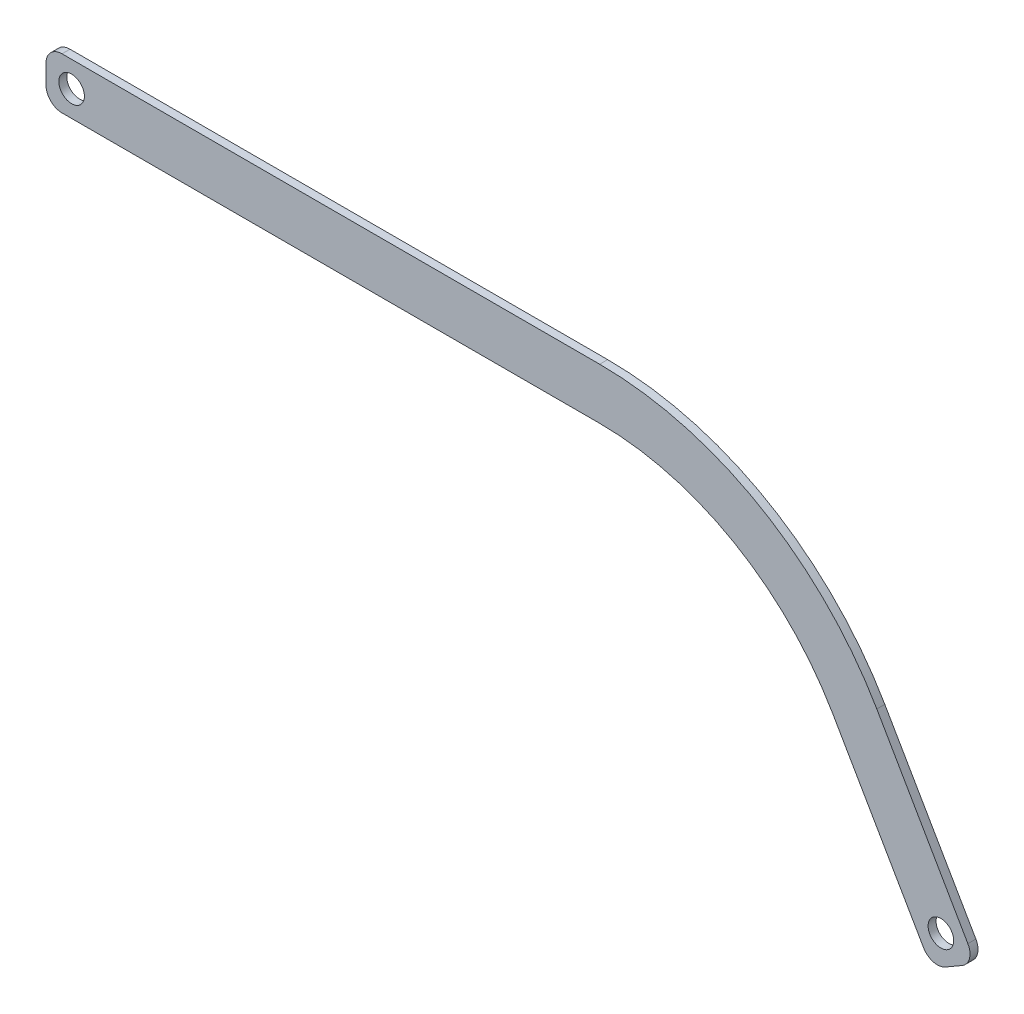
ISO-10303-21;
HEADER;
FILE_DESCRIPTION(('STEP AP214'),'2;1');
FILE_NAME('part.step','',(''),(''),'','','');
FILE_SCHEMA(('AUTOMOTIVE_DESIGN { 1 0 10303 214 1 1 1 1 }'));
ENDSEC;
DATA;
#1=APPLICATION_CONTEXT('core data for automotive mechanical design processes');
#2=APPLICATION_PROTOCOL_DEFINITION('international standard','automotive_design',2000,#1);
#3=PRODUCT_CONTEXT('',#1,'mechanical');
#4=PRODUCT('Part','Part','',(#3));
#5=PRODUCT_RELATED_PRODUCT_CATEGORY('part','',(#4));
#6=PRODUCT_DEFINITION_FORMATION('','',#4);
#7=PRODUCT_DEFINITION_CONTEXT('part definition',#1,'design');
#8=PRODUCT_DEFINITION('design','',#6,#7);
#9=PRODUCT_DEFINITION_SHAPE('','',#8);
#10=(LENGTH_UNIT() NAMED_UNIT(*) SI_UNIT(.MILLI.,.METRE.));
#11=(NAMED_UNIT(*) PLANE_ANGLE_UNIT() SI_UNIT($,.RADIAN.));
#12=(NAMED_UNIT(*) SI_UNIT($,.STERADIAN.) SOLID_ANGLE_UNIT());
#13=UNCERTAINTY_MEASURE_WITH_UNIT(LENGTH_MEASURE(1.E-05),#10,'distance_accuracy_value','');
#14=(GEOMETRIC_REPRESENTATION_CONTEXT(3) GLOBAL_UNCERTAINTY_ASSIGNED_CONTEXT((#13)) GLOBAL_UNIT_ASSIGNED_CONTEXT((#10,
#11,#12)) REPRESENTATION_CONTEXT('',''));
#15=CARTESIAN_POINT('',(0.,0.,0.));
#16=DIRECTION('',(0.,0.,1.));
#17=DIRECTION('',(1.,0.,0.));
#18=AXIS2_PLACEMENT_3D('',#15,#16,#17);
#19=CARTESIAN_POINT('',(330.,-184.,-5.));
#20=DIRECTION('',(0.,0.,1.));
#21=DIRECTION('',(1.,0.,0.));
#22=AXIS2_PLACEMENT_3D('',#19,#20,#21);
#23=CYLINDRICAL_SURFACE('',#22,200.);
#24=CARTESIAN_POINT('',(330.,-184.,0.));
#25=DIRECTION('',(0.,0.,1.));
#26=DIRECTION('',(1.,0.,0.));
#27=AXIS2_PLACEMENT_3D('',#24,#25,#26);
#28=CIRCLE('',#27,200.);
#29=CARTESIAN_POINT('',(503.205080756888,-83.9999999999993,0.));
#30=VERTEX_POINT('',#29);
#31=CARTESIAN_POINT('',(330.,16.,0.));
#32=VERTEX_POINT('',#31);
#33=EDGE_CURVE('E114',#30,#32,#28,.T.);
#34=ORIENTED_EDGE('',*,*,#33,.F.);
#35=DIRECTION('',(0.,0.,1.));
#36=VECTOR('',#35,1.);
#37=CARTESIAN_POINT('',(503.205080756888,-83.9999999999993,-5.));
#38=LINE('',#37,#36);
#39=CARTESIAN_POINT('',(503.205080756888,-83.9999999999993,-5.));
#40=VERTEX_POINT('',#39);
#41=EDGE_CURVE('E11',#40,#30,#38,.T.);
#42=ORIENTED_EDGE('',*,*,#41,.F.);
#43=CARTESIAN_POINT('',(330.,-184.,-5.));
#44=DIRECTION('',(0.,0.,1.));
#45=DIRECTION('',(1.,0.,0.));
#46=AXIS2_PLACEMENT_3D('',#43,#44,#45);
#47=CIRCLE('',#46,200.);
#48=CARTESIAN_POINT('',(330.,16.,-5.));
#49=VERTEX_POINT('',#48);
#50=EDGE_CURVE('E116',#40,#49,#47,.T.);
#51=ORIENTED_EDGE('',*,*,#50,.T.);
#52=DIRECTION('',(0.,0.,1.));
#53=VECTOR('',#52,1.);
#54=CARTESIAN_POINT('',(330.,16.,-5.));
#55=LINE('',#54,#53);
#56=EDGE_CURVE('E29',#49,#32,#55,.T.);
#57=ORIENTED_EDGE('',*,*,#56,.T.);
#58=EDGE_LOOP('',(#34,#42,#51,#57));
#59=FACE_BOUND('',#58,.T.);
#60=ADVANCED_FACE('F26',(#59),#23,.T.);
#61=CARTESIAN_POINT('',(503.205080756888,-83.9999999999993,-5.));
#62=DIRECTION('',(0.866025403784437,0.500000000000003,0.));
#63=DIRECTION('',(-0.500000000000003,0.866025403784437,0.));
#64=AXIS2_PLACEMENT_3D('',#61,#62,#63);
#65=PLANE('',#64);
#66=DIRECTION('',(-0.500000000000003,0.866025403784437,0.));
#67=VECTOR('',#66,1.);
#68=CARTESIAN_POINT('',(503.205080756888,-83.9999999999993,0.));
#69=LINE('',#68,#67);
#70=CARTESIAN_POINT('',(560.104768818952,-182.553150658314,0.));
#71=VERTEX_POINT('',#70);
#72=EDGE_CURVE('E132',#71,#30,#69,.T.);
#73=ORIENTED_EDGE('',*,*,#72,.F.);
#74=DIRECTION('',(0.,0.,1.));
#75=VECTOR('',#74,1.);
#76=CARTESIAN_POINT('',(560.104768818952,-182.553150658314,-5.));
#77=LINE('',#76,#75);
#78=CARTESIAN_POINT('',(560.104768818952,-182.553150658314,-5.));
#79=VERTEX_POINT('',#78);
#80=EDGE_CURVE('E34',#79,#71,#77,.T.);
#81=ORIENTED_EDGE('',*,*,#80,.F.);
#82=DIRECTION('',(-0.500000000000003,0.866025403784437,0.));
#83=VECTOR('',#82,1.);
#84=CARTESIAN_POINT('',(503.205080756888,-83.9999999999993,-5.));
#85=LINE('',#84,#83);
#86=EDGE_CURVE('E121',#79,#40,#85,.T.);
#87=ORIENTED_EDGE('',*,*,#86,.T.);
#88=ORIENTED_EDGE('',*,*,#41,.T.);
#89=EDGE_LOOP('',(#73,#81,#87,#88));
#90=FACE_BOUND('',#89,.T.);
#91=ADVANCED_FACE('F244',(#90),#65,.T.);
#92=CARTESIAN_POINT('',(551.444514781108,-187.553150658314,-5.));
#93=DIRECTION('',(0.,0.,1.));
#94=DIRECTION('',(1.,0.,0.));
#95=AXIS2_PLACEMENT_3D('',#92,#93,#94);
#96=CYLINDRICAL_SURFACE('',#95,10.0000000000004);
#97=CARTESIAN_POINT('',(551.444514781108,-187.553150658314,0.));
#98=DIRECTION('',(0.,0.,1.));
#99=DIRECTION('',(-1.,0.,0.));
#100=AXIS2_PLACEMENT_3D('',#97,#98,#99);
#101=CIRCLE('',#100,10.0000000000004);
#102=CARTESIAN_POINT('',(556.444514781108,-196.213404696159,0.));
#103=VERTEX_POINT('',#102);
#104=EDGE_CURVE('E162',#103,#71,#101,.T.);
#105=ORIENTED_EDGE('',*,*,#104,.F.);
#106=DIRECTION('',(0.,0.,1.));
#107=VECTOR('',#106,1.);
#108=CARTESIAN_POINT('',(556.444514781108,-196.213404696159,-5.));
#109=LINE('',#108,#107);
#110=CARTESIAN_POINT('',(556.444514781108,-196.213404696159,-5.));
#111=VERTEX_POINT('',#110);
#112=EDGE_CURVE('E196',#111,#103,#109,.T.);
#113=ORIENTED_EDGE('',*,*,#112,.F.);
#114=CARTESIAN_POINT('',(551.444514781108,-187.553150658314,-5.));
#115=DIRECTION('',(0.,0.,1.));
#116=DIRECTION('',(-1.,0.,0.));
#117=AXIS2_PLACEMENT_3D('',#114,#115,#116);
#118=CIRCLE('',#117,10.0000000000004);
#119=EDGE_CURVE('E192',#111,#79,#118,.T.);
#120=ORIENTED_EDGE('',*,*,#119,.T.);
#121=ORIENTED_EDGE('',*,*,#80,.T.);
#122=EDGE_LOOP('',(#105,#113,#120,#121));
#123=FACE_BOUND('',#122,.T.);
#124=ADVANCED_FACE('F249',(#123),#96,.T.);
#125=CARTESIAN_POINT('',(556.444514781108,-196.213404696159,-5.));
#126=DIRECTION('',(0.500000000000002,-0.866025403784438,0.));
#127=DIRECTION('',(0.866025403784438,0.500000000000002,0.));
#128=AXIS2_PLACEMENT_3D('',#125,#126,#127);
#129=PLANE('',#128);
#130=DIRECTION('',(0.866025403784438,0.500000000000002,0.));
#131=VECTOR('',#130,1.);
#132=CARTESIAN_POINT('',(556.444514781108,-196.213404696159,0.));
#133=LINE('',#132,#131);
#134=CARTESIAN_POINT('',(546.052209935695,-202.213404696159,0.));
#135=VERTEX_POINT('',#134);
#136=EDGE_CURVE('E159',#135,#103,#133,.T.);
#137=ORIENTED_EDGE('',*,*,#136,.F.);
#138=DIRECTION('',(0.,0.,1.));
#139=VECTOR('',#138,1.);
#140=CARTESIAN_POINT('',(546.052209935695,-202.213404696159,-5.));
#141=LINE('',#140,#139);
#142=CARTESIAN_POINT('',(546.052209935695,-202.213404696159,-5.));
#143=VERTEX_POINT('',#142);
#144=EDGE_CURVE('E198',#143,#135,#141,.T.);
#145=ORIENTED_EDGE('',*,*,#144,.F.);
#146=DIRECTION('',(0.866025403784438,0.500000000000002,0.));
#147=VECTOR('',#146,1.);
#148=CARTESIAN_POINT('',(556.444514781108,-196.213404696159,-5.));
#149=LINE('',#148,#147);
#150=EDGE_CURVE('E189',#143,#111,#149,.T.);
#151=ORIENTED_EDGE('',*,*,#150,.T.);
#152=ORIENTED_EDGE('',*,*,#112,.T.);
#153=EDGE_LOOP('',(#137,#145,#151,#152));
#154=FACE_BOUND('',#153,.T.);
#155=ADVANCED_FACE('F241',(#154),#129,.T.);
#156=CARTESIAN_POINT('',(541.052209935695,-193.553150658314,-5.));
#157=DIRECTION('',(0.,0.,1.));
#158=DIRECTION('',(1.,0.,0.));
#159=AXIS2_PLACEMENT_3D('',#156,#157,#158);
#160=CYLINDRICAL_SURFACE('',#159,10.0000000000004);
#161=CARTESIAN_POINT('',(541.052209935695,-193.553150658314,0.));
#162=DIRECTION('',(0.,0.,1.));
#163=DIRECTION('',(1.,0.,0.));
#164=AXIS2_PLACEMENT_3D('',#161,#162,#163);
#165=CIRCLE('',#164,10.0000000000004);
#166=CARTESIAN_POINT('',(532.39195589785,-198.553150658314,0.));
#167=VERTEX_POINT('',#166);
#168=EDGE_CURVE('E156',#167,#135,#165,.T.);
#169=ORIENTED_EDGE('',*,*,#168,.F.);
#170=DIRECTION('',(0.,0.,1.));
#171=VECTOR('',#170,1.);
#172=CARTESIAN_POINT('',(532.39195589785,-198.553150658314,-5.));
#173=LINE('',#172,#171);
#174=CARTESIAN_POINT('',(532.39195589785,-198.553150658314,-5.));
#175=VERTEX_POINT('',#174);
#176=EDGE_CURVE('E200',#175,#167,#173,.T.);
#177=ORIENTED_EDGE('',*,*,#176,.F.);
#178=CARTESIAN_POINT('',(541.052209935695,-193.553150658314,-5.));
#179=DIRECTION('',(0.,0.,1.));
#180=DIRECTION('',(1.,0.,0.));
#181=AXIS2_PLACEMENT_3D('',#178,#179,#180);
#182=CIRCLE('',#181,10.0000000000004);
#183=EDGE_CURVE('E186',#175,#143,#182,.T.);
#184=ORIENTED_EDGE('',*,*,#183,.T.);
#185=ORIENTED_EDGE('',*,*,#144,.T.);
#186=EDGE_LOOP('',(#169,#177,#184,#185));
#187=FACE_BOUND('',#186,.T.);
#188=ADVANCED_FACE('F237',(#187),#160,.T.);
#189=CARTESIAN_POINT('',(475.492267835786,-99.9999999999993,-5.));
#190=DIRECTION('',(-0.866025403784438,-0.500000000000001,0.));
#191=DIRECTION('',(0.500000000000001,-0.866025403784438,0.));
#192=AXIS2_PLACEMENT_3D('',#189,#190,#191);
#193=PLANE('',#192);
#194=DIRECTION('',(0.500000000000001,-0.866025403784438,0.));
#195=VECTOR('',#194,1.);
#196=CARTESIAN_POINT('',(475.492267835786,-99.9999999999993,0.));
#197=LINE('',#196,#195);
#198=CARTESIAN_POINT('',(475.492267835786,-99.9999999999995,0.));
#199=VERTEX_POINT('',#198);
#200=EDGE_CURVE('E153',#199,#167,#197,.T.);
#201=ORIENTED_EDGE('',*,*,#200,.F.);
#202=DIRECTION('',(0.,0.,1.));
#203=VECTOR('',#202,1.);
#204=CARTESIAN_POINT('',(475.492267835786,-99.9999999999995,-5.));
#205=LINE('',#204,#203);
#206=CARTESIAN_POINT('',(475.492267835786,-99.9999999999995,-5.));
#207=VERTEX_POINT('',#206);
#208=EDGE_CURVE('E202',#207,#199,#205,.T.);
#209=ORIENTED_EDGE('',*,*,#208,.F.);
#210=DIRECTION('',(0.500000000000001,-0.866025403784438,0.));
#211=VECTOR('',#210,1.);
#212=CARTESIAN_POINT('',(475.492267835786,-99.9999999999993,-5.));
#213=LINE('',#212,#211);
#214=EDGE_CURVE('E183',#207,#175,#213,.T.);
#215=ORIENTED_EDGE('',*,*,#214,.T.);
#216=ORIENTED_EDGE('',*,*,#176,.T.);
#217=EDGE_LOOP('',(#201,#209,#215,#216));
#218=FACE_BOUND('',#217,.T.);
#219=ADVANCED_FACE('F233',(#218),#193,.T.);
#220=CARTESIAN_POINT('',(330.,-184.,-5.));
#221=DIRECTION('',(0.,0.,1.));
#222=DIRECTION('',(1.,0.,0.));
#223=AXIS2_PLACEMENT_3D('',#220,#221,#222);
#224=CYLINDRICAL_SURFACE('',#223,168.);
#225=CARTESIAN_POINT('',(330.,-184.,0.));
#226=DIRECTION('',(0.,0.,-1.));
#227=DIRECTION('',(1.,0.,0.));
#228=AXIS2_PLACEMENT_3D('',#225,#226,#227);
#229=CIRCLE('',#228,168.);
#230=CARTESIAN_POINT('',(330.,-16.,0.));
#231=VERTEX_POINT('',#230);
#232=EDGE_CURVE('E150',#231,#199,#229,.T.);
#233=ORIENTED_EDGE('',*,*,#232,.F.);
#234=DIRECTION('',(0.,0.,1.));
#235=VECTOR('',#234,1.);
#236=CARTESIAN_POINT('',(330.,-16.,-5.));
#237=LINE('',#236,#235);
#238=CARTESIAN_POINT('',(330.,-16.,-5.));
#239=VERTEX_POINT('',#238);
#240=EDGE_CURVE('E204',#239,#231,#237,.T.);
#241=ORIENTED_EDGE('',*,*,#240,.F.);
#242=CARTESIAN_POINT('',(330.,-184.,-5.));
#243=DIRECTION('',(0.,0.,-1.));
#244=DIRECTION('',(1.,0.,0.));
#245=AXIS2_PLACEMENT_3D('',#242,#243,#244);
#246=CIRCLE('',#245,168.);
#247=EDGE_CURVE('E180',#239,#207,#246,.T.);
#248=ORIENTED_EDGE('',*,*,#247,.T.);
#249=ORIENTED_EDGE('',*,*,#208,.T.);
#250=EDGE_LOOP('',(#233,#241,#248,#249));
#251=FACE_BOUND('',#250,.T.);
#252=ADVANCED_FACE('F229',(#251),#224,.F.);
#253=CARTESIAN_POINT('',(-6.,-16.,-5.));
#254=DIRECTION('',(0.,-1.,0.));
#255=DIRECTION('',(1.,0.,0.));
#256=AXIS2_PLACEMENT_3D('',#253,#254,#255);
#257=PLANE('',#256);
#258=DIRECTION('',(1.,0.,0.));
#259=VECTOR('',#258,1.);
#260=CARTESIAN_POINT('',(-6.,-16.,0.));
#261=LINE('',#260,#259);
#262=CARTESIAN_POINT('',(-6.,-16.,0.));
#263=VERTEX_POINT('',#262);
#264=EDGE_CURVE('E147',#263,#231,#261,.T.);
#265=ORIENTED_EDGE('',*,*,#264,.F.);
#266=DIRECTION('',(0.,0.,1.));
#267=VECTOR('',#266,1.);
#268=CARTESIAN_POINT('',(-6.,-16.,-5.));
#269=LINE('',#268,#267);
#270=CARTESIAN_POINT('',(-6.,-16.,-5.));
#271=VERTEX_POINT('',#270);
#272=EDGE_CURVE('E206',#271,#263,#269,.T.);
#273=ORIENTED_EDGE('',*,*,#272,.F.);
#274=DIRECTION('',(1.,0.,0.));
#275=VECTOR('',#274,1.);
#276=CARTESIAN_POINT('',(-6.,-16.,-5.));
#277=LINE('',#276,#275);
#278=EDGE_CURVE('E177',#271,#239,#277,.T.);
#279=ORIENTED_EDGE('',*,*,#278,.T.);
#280=ORIENTED_EDGE('',*,*,#240,.T.);
#281=EDGE_LOOP('',(#265,#273,#279,#280));
#282=FACE_BOUND('',#281,.T.);
#283=ADVANCED_FACE('F225',(#282),#257,.T.);
#284=CARTESIAN_POINT('',(-6.,-6.,-5.));
#285=DIRECTION('',(0.,0.,1.));
#286=DIRECTION('',(1.,0.,0.));
#287=AXIS2_PLACEMENT_3D('',#284,#285,#286);
#288=CYLINDRICAL_SURFACE('',#287,10.);
#289=CARTESIAN_POINT('',(-6.,-6.,0.));
#290=DIRECTION('',(0.,0.,1.));
#291=DIRECTION('',(-1.,0.,0.));
#292=AXIS2_PLACEMENT_3D('',#289,#290,#291);
#293=CIRCLE('',#292,10.);
#294=CARTESIAN_POINT('',(-16.,-6.,0.));
#295=VERTEX_POINT('',#294);
#296=EDGE_CURVE('E144',#295,#263,#293,.T.);
#297=ORIENTED_EDGE('',*,*,#296,.F.);
#298=DIRECTION('',(0.,0.,1.));
#299=VECTOR('',#298,1.);
#300=CARTESIAN_POINT('',(-16.,-6.,-5.));
#301=LINE('',#300,#299);
#302=CARTESIAN_POINT('',(-16.,-6.,-5.));
#303=VERTEX_POINT('',#302);
#304=EDGE_CURVE('E208',#303,#295,#301,.T.);
#305=ORIENTED_EDGE('',*,*,#304,.F.);
#306=CARTESIAN_POINT('',(-6.,-6.,-5.));
#307=DIRECTION('',(0.,0.,1.));
#308=DIRECTION('',(-1.,0.,0.));
#309=AXIS2_PLACEMENT_3D('',#306,#307,#308);
#310=CIRCLE('',#309,10.);
#311=EDGE_CURVE('E174',#303,#271,#310,.T.);
#312=ORIENTED_EDGE('',*,*,#311,.T.);
#313=ORIENTED_EDGE('',*,*,#272,.T.);
#314=EDGE_LOOP('',(#297,#305,#312,#313));
#315=FACE_BOUND('',#314,.T.);
#316=ADVANCED_FACE('F221',(#315),#288,.T.);
#317=CARTESIAN_POINT('',(-16.,6.,-5.));
#318=DIRECTION('',(-1.,0.,0.));
#319=DIRECTION('',(0.,-1.,0.));
#320=AXIS2_PLACEMENT_3D('',#317,#318,#319);
#321=PLANE('',#320);
#322=DIRECTION('',(0.,-1.,0.));
#323=VECTOR('',#322,1.);
#324=CARTESIAN_POINT('',(-16.,6.,0.));
#325=LINE('',#324,#323);
#326=CARTESIAN_POINT('',(-16.,6.,0.));
#327=VERTEX_POINT('',#326);
#328=EDGE_CURVE('E141',#327,#295,#325,.T.);
#329=ORIENTED_EDGE('',*,*,#328,.F.);
#330=DIRECTION('',(0.,0.,1.));
#331=VECTOR('',#330,1.);
#332=CARTESIAN_POINT('',(-16.,6.,-5.));
#333=LINE('',#332,#331);
#334=CARTESIAN_POINT('',(-16.,6.,-5.));
#335=VERTEX_POINT('',#334);
#336=EDGE_CURVE('E210',#335,#327,#333,.T.);
#337=ORIENTED_EDGE('',*,*,#336,.F.);
#338=DIRECTION('',(0.,-1.,0.));
#339=VECTOR('',#338,1.);
#340=CARTESIAN_POINT('',(-16.,6.,-5.));
#341=LINE('',#340,#339);
#342=EDGE_CURVE('E171',#335,#303,#341,.T.);
#343=ORIENTED_EDGE('',*,*,#342,.T.);
#344=ORIENTED_EDGE('',*,*,#304,.T.);
#345=EDGE_LOOP('',(#329,#337,#343,#344));
#346=FACE_BOUND('',#345,.T.);
#347=ADVANCED_FACE('F217',(#346),#321,.T.);
#348=CARTESIAN_POINT('',(-6.,6.,-5.));
#349=DIRECTION('',(0.,0.,1.));
#350=DIRECTION('',(1.,0.,0.));
#351=AXIS2_PLACEMENT_3D('',#348,#349,#350);
#352=CYLINDRICAL_SURFACE('',#351,10.);
#353=CARTESIAN_POINT('',(-6.,6.,0.));
#354=DIRECTION('',(0.,0.,1.));
#355=DIRECTION('',(1.,0.,0.));
#356=AXIS2_PLACEMENT_3D('',#353,#354,#355);
#357=CIRCLE('',#356,10.);
#358=CARTESIAN_POINT('',(-6.,16.,0.));
#359=VERTEX_POINT('',#358);
#360=EDGE_CURVE('E128',#359,#327,#357,.T.);
#361=ORIENTED_EDGE('',*,*,#360,.F.);
#362=DIRECTION('',(0.,0.,1.));
#363=VECTOR('',#362,1.);
#364=CARTESIAN_POINT('',(-6.,16.,-5.));
#365=LINE('',#364,#363);
#366=CARTESIAN_POINT('',(-6.,16.,-5.));
#367=VERTEX_POINT('',#366);
#368=EDGE_CURVE('E120',#367,#359,#365,.T.);
#369=ORIENTED_EDGE('',*,*,#368,.F.);
#370=CARTESIAN_POINT('',(-6.,6.,-5.));
#371=DIRECTION('',(0.,0.,1.));
#372=DIRECTION('',(1.,0.,0.));
#373=AXIS2_PLACEMENT_3D('',#370,#371,#372);
#374=CIRCLE('',#373,10.);
#375=EDGE_CURVE('E168',#367,#335,#374,.T.);
#376=ORIENTED_EDGE('',*,*,#375,.T.);
#377=ORIENTED_EDGE('',*,*,#336,.T.);
#378=EDGE_LOOP('',(#361,#369,#376,#377));
#379=FACE_BOUND('',#378,.T.);
#380=ADVANCED_FACE('F213',(#379),#352,.T.);
#381=CARTESIAN_POINT('',(-6.,16.,-5.));
#382=DIRECTION('',(0.,1.,0.));
#383=DIRECTION('',(-1.,0.,0.));
#384=AXIS2_PLACEMENT_3D('',#381,#382,#383);
#385=PLANE('',#384);
#386=DIRECTION('',(-1.,0.,0.));
#387=VECTOR('',#386,1.);
#388=CARTESIAN_POINT('',(-6.,16.,0.));
#389=LINE('',#388,#387);
#390=EDGE_CURVE('E123',#32,#359,#389,.T.);
#391=ORIENTED_EDGE('',*,*,#390,.F.);
#392=ORIENTED_EDGE('',*,*,#56,.F.);
#393=DIRECTION('',(-1.,0.,0.));
#394=VECTOR('',#393,1.);
#395=CARTESIAN_POINT('',(-6.,16.,-5.));
#396=LINE('',#395,#394);
#397=EDGE_CURVE('E166',#49,#367,#396,.T.);
#398=ORIENTED_EDGE('',*,*,#397,.T.);
#399=ORIENTED_EDGE('',*,*,#368,.T.);
#400=EDGE_LOOP('',(#391,#392,#398,#399));
#401=FACE_BOUND('',#400,.T.);
#402=ADVANCED_FACE('F124',(#401),#385,.T.);
#403=CARTESIAN_POINT('',(330.,-184.,-5.));
#404=DIRECTION('',(0.,0.,1.));
#405=DIRECTION('',(1.,0.,0.));
#406=AXIS2_PLACEMENT_3D('',#403,#404,#405);
#407=PLANE('',#406);
#408=CARTESIAN_POINT('',(543.248362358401,-185.356998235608,-5.));
#409=DIRECTION('',(0.,0.,1.));
#410=DIRECTION('',(1.,0.,0.));
#411=AXIS2_PLACEMENT_3D('',#408,#409,#410);
#412=CIRCLE('',#411,7.99999999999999);
#413=CARTESIAN_POINT('',(551.248362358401,-185.356998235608,-5.));
#414=VERTEX_POINT('',#413);
#415=EDGE_CURVE('E353',#414,#414,#412,.T.);
#416=ORIENTED_EDGE('',*,*,#415,.T.);
#417=EDGE_LOOP('',(#416));
#418=FACE_BOUND('',#417,.T.);
#419=CARTESIAN_POINT('',(0.,0.,-5.));
#420=DIRECTION('',(0.,0.,1.));
#421=DIRECTION('',(1.,0.,0.));
#422=AXIS2_PLACEMENT_3D('',#419,#420,#421);
#423=CIRCLE('',#422,8.);
#424=CARTESIAN_POINT('',(8.,0.,-5.));
#425=VERTEX_POINT('',#424);
#426=EDGE_CURVE('E133',#425,#425,#423,.T.);
#427=ORIENTED_EDGE('',*,*,#426,.T.);
#428=EDGE_LOOP('',(#427));
#429=FACE_BOUND('',#428,.T.);
#430=ORIENTED_EDGE('',*,*,#50,.F.);
#431=ORIENTED_EDGE('',*,*,#86,.F.);
#432=ORIENTED_EDGE('',*,*,#119,.F.);
#433=ORIENTED_EDGE('',*,*,#150,.F.);
#434=ORIENTED_EDGE('',*,*,#183,.F.);
#435=ORIENTED_EDGE('',*,*,#214,.F.);
#436=ORIENTED_EDGE('',*,*,#247,.F.);
#437=ORIENTED_EDGE('',*,*,#278,.F.);
#438=ORIENTED_EDGE('',*,*,#311,.F.);
#439=ORIENTED_EDGE('',*,*,#342,.F.);
#440=ORIENTED_EDGE('',*,*,#375,.F.);
#441=ORIENTED_EDGE('',*,*,#397,.F.);
#442=EDGE_LOOP('',(#430,#431,#432,#433,#434,#435,#436,#437,#438,#439,#440,#441));
#443=FACE_BOUND('',#442,.T.);
#444=ADVANCED_FACE('F248',(#418,#429,#443),#407,.F.);
#445=CARTESIAN_POINT('',(330.,-184.,0.));
#446=DIRECTION('',(0.,0.,1.));
#447=DIRECTION('',(1.,0.,0.));
#448=AXIS2_PLACEMENT_3D('',#445,#446,#447);
#449=PLANE('',#448);
#450=CARTESIAN_POINT('',(543.248362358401,-185.356998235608,0.));
#451=DIRECTION('',(0.,0.,1.));
#452=DIRECTION('',(1.,0.,0.));
#453=AXIS2_PLACEMENT_3D('',#450,#451,#452);
#454=CIRCLE('',#453,7.99999999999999);
#455=CARTESIAN_POINT('',(551.248362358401,-185.356998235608,0.));
#456=VERTEX_POINT('',#455);
#457=EDGE_CURVE('E356',#456,#456,#454,.T.);
#458=ORIENTED_EDGE('',*,*,#457,.F.);
#459=EDGE_LOOP('',(#458));
#460=FACE_BOUND('',#459,.T.);
#461=CARTESIAN_POINT('',(0.,0.,0.));
#462=DIRECTION('',(0.,0.,1.));
#463=DIRECTION('',(1.,0.,0.));
#464=AXIS2_PLACEMENT_3D('',#461,#462,#463);
#465=CIRCLE('',#464,8.);
#466=CARTESIAN_POINT('',(8.,0.,0.));
#467=VERTEX_POINT('',#466);
#468=EDGE_CURVE('E136',#467,#467,#465,.T.);
#469=ORIENTED_EDGE('',*,*,#468,.F.);
#470=EDGE_LOOP('',(#469));
#471=FACE_BOUND('',#470,.T.);
#472=ORIENTED_EDGE('',*,*,#33,.T.);
#473=ORIENTED_EDGE('',*,*,#390,.T.);
#474=ORIENTED_EDGE('',*,*,#360,.T.);
#475=ORIENTED_EDGE('',*,*,#328,.T.);
#476=ORIENTED_EDGE('',*,*,#296,.T.);
#477=ORIENTED_EDGE('',*,*,#264,.T.);
#478=ORIENTED_EDGE('',*,*,#232,.T.);
#479=ORIENTED_EDGE('',*,*,#200,.T.);
#480=ORIENTED_EDGE('',*,*,#168,.T.);
#481=ORIENTED_EDGE('',*,*,#136,.T.);
#482=ORIENTED_EDGE('',*,*,#104,.T.);
#483=ORIENTED_EDGE('',*,*,#72,.T.);
#484=EDGE_LOOP('',(#472,#473,#474,#475,#476,#477,#478,#479,#480,#481,#482,#483));
#485=FACE_BOUND('',#484,.T.);
#486=ADVANCED_FACE('F130',(#460,#471,#485),#449,.T.);
#487=CARTESIAN_POINT('',(0.,0.,-5.));
#488=DIRECTION('',(0.,0.,1.));
#489=DIRECTION('',(1.,0.,0.));
#490=AXIS2_PLACEMENT_3D('',#487,#488,#489);
#491=CYLINDRICAL_SURFACE('',#490,8.);
#492=ORIENTED_EDGE('',*,*,#426,.F.);
#493=EDGE_LOOP('',(#492));
#494=FACE_BOUND('',#493,.T.);
#495=ORIENTED_EDGE('',*,*,#468,.T.);
#496=EDGE_LOOP('',(#495));
#497=FACE_BOUND('',#496,.T.);
#498=ADVANCED_FACE('F332',(#494,#497),#491,.F.);
#499=CARTESIAN_POINT('',(543.248362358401,-185.356998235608,-5.));
#500=DIRECTION('',(0.,0.,1.));
#501=DIRECTION('',(1.,0.,0.));
#502=AXIS2_PLACEMENT_3D('',#499,#500,#501);
#503=CYLINDRICAL_SURFACE('',#502,7.99999999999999);
#504=ORIENTED_EDGE('',*,*,#415,.F.);
#505=EDGE_LOOP('',(#504));
#506=FACE_BOUND('',#505,.T.);
#507=ORIENTED_EDGE('',*,*,#457,.T.);
#508=EDGE_LOOP('',(#507));
#509=FACE_BOUND('',#508,.T.);
#510=ADVANCED_FACE('F340',(#506,#509),#503,.F.);
#511=CLOSED_SHELL('',(#60,#91,#124,#155,#188,#219,#252,#283,#316,#347,#380,#402,#444,#486,#498,#510));
#512=MANIFOLD_SOLID_BREP('B2',#511);
#513=ADVANCED_BREP_SHAPE_REPRESENTATION('',(#18,#512),#14);
#514=SHAPE_DEFINITION_REPRESENTATION(#9,#513);
ENDSEC;
END-ISO-10303-21;
